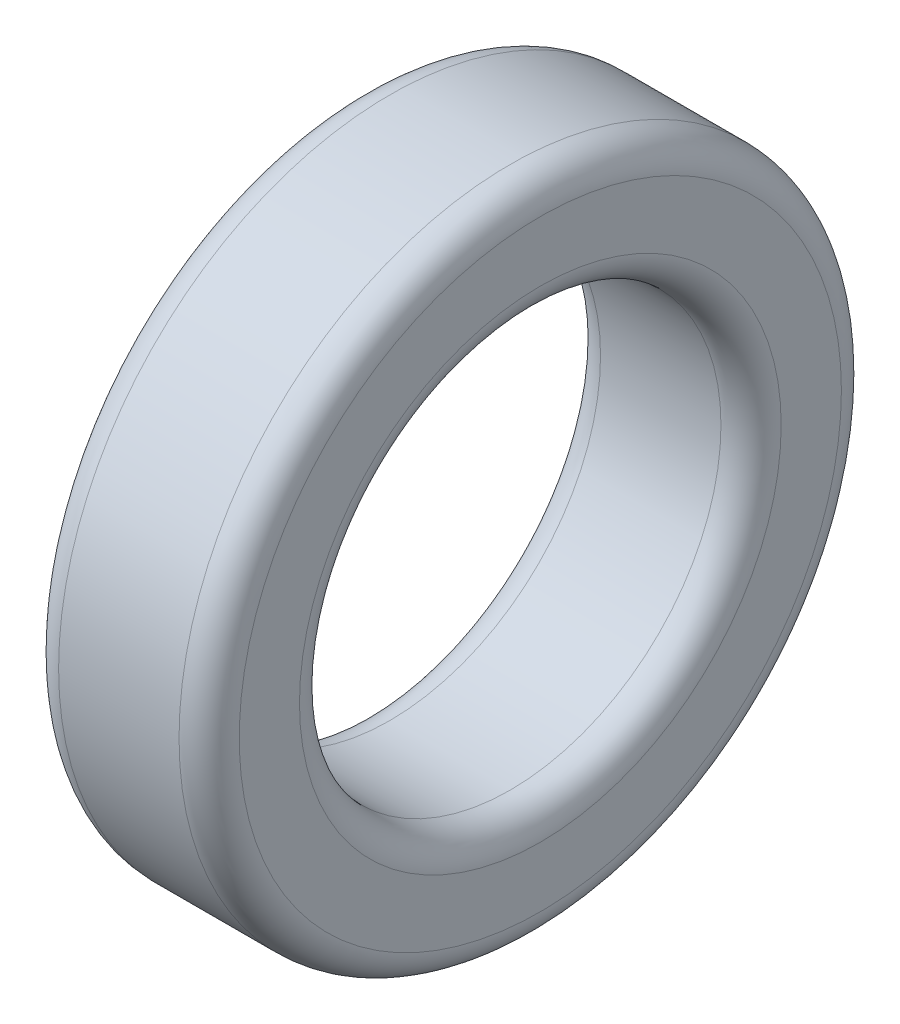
ISO-10303-21;
HEADER;
FILE_DESCRIPTION(('STEP AP214'),'2;1');
FILE_NAME('part.step','',(''),(''),'','','');
FILE_SCHEMA(('AUTOMOTIVE_DESIGN { 1 0 10303 214 1 1 1 1 }'));
ENDSEC;
DATA;
#1=APPLICATION_CONTEXT('core data for automotive mechanical design processes');
#2=APPLICATION_PROTOCOL_DEFINITION('international standard','automotive_design',2000,#1);
#3=PRODUCT_CONTEXT('',#1,'mechanical');
#4=PRODUCT('Part','Part','',(#3));
#5=PRODUCT_RELATED_PRODUCT_CATEGORY('part','',(#4));
#6=PRODUCT_DEFINITION_FORMATION('','',#4);
#7=PRODUCT_DEFINITION_CONTEXT('part definition',#1,'design');
#8=PRODUCT_DEFINITION('design','',#6,#7);
#9=PRODUCT_DEFINITION_SHAPE('','',#8);
#10=(LENGTH_UNIT() NAMED_UNIT(*) SI_UNIT(.MILLI.,.METRE.));
#11=(NAMED_UNIT(*) PLANE_ANGLE_UNIT() SI_UNIT($,.RADIAN.));
#12=(NAMED_UNIT(*) SI_UNIT($,.STERADIAN.) SOLID_ANGLE_UNIT());
#13=UNCERTAINTY_MEASURE_WITH_UNIT(LENGTH_MEASURE(1.E-05),#10,'distance_accuracy_value','');
#14=(GEOMETRIC_REPRESENTATION_CONTEXT(3) GLOBAL_UNCERTAINTY_ASSIGNED_CONTEXT((#13)) GLOBAL_UNIT_ASSIGNED_CONTEXT((#10,
#11,#12)) REPRESENTATION_CONTEXT('',''));
#15=CARTESIAN_POINT('',(0.,0.,0.));
#16=DIRECTION('',(0.,0.,1.));
#17=DIRECTION('',(1.,0.,0.));
#18=AXIS2_PLACEMENT_3D('',#15,#16,#17);
#19=CARTESIAN_POINT('',(11.9999999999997,-40.3284905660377,-94.5071698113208));
#20=DIRECTION('',(1.,0.,0.));
#21=DIRECTION('',(0.,0.,-1.));
#22=AXIS2_PLACEMENT_3D('',#19,#20,#21);
#23=TOROIDAL_SURFACE('',#22,4.99999999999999,0.500000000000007);
#24=CARTESIAN_POINT('',(11.9999999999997,-40.3284905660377,-94.5071698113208));
#25=DIRECTION('',(1.,0.,0.));
#26=DIRECTION('',(0.,0.,-1.));
#27=AXIS2_PLACEMENT_3D('',#24,#25,#26);
#28=CIRCLE('',#27,5.5);
#29=CARTESIAN_POINT('',(11.9999999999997,-40.3284905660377,-100.007169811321));
#30=VERTEX_POINT('',#29);
#31=EDGE_CURVE('E10',#30,#30,#28,.T.);
#32=ORIENTED_EDGE('',*,*,#31,.T.);
#33=EDGE_LOOP('',(#32));
#34=FACE_BOUND('',#33,.T.);
#35=CARTESIAN_POINT('',(12.4999999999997,-40.3284905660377,-94.5071698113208));
#36=DIRECTION('',(1.,0.,0.));
#37=DIRECTION('',(0.,0.,-1.));
#38=AXIS2_PLACEMENT_3D('',#35,#36,#37);
#39=CIRCLE('',#38,4.99999999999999);
#40=CARTESIAN_POINT('',(12.4999999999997,-40.3284905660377,-99.5071698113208));
#41=VERTEX_POINT('',#40);
#42=EDGE_CURVE('E48',#41,#41,#39,.T.);
#43=ORIENTED_EDGE('',*,*,#42,.F.);
#44=EDGE_LOOP('',(#43));
#45=FACE_BOUND('',#44,.T.);
#46=ADVANCED_FACE('F20',(#34,#45),#23,.T.);
#47=CARTESIAN_POINT('',(18.9999999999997,-40.3284905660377,-94.5071698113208));
#48=DIRECTION('',(1.,0.,0.));
#49=DIRECTION('',(0.,0.,-1.));
#50=AXIS2_PLACEMENT_3D('',#47,#48,#49);
#51=CYLINDRICAL_SURFACE('',#50,5.5);
#52=CARTESIAN_POINT('',(9.99999999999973,-40.3284905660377,-94.5071698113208));
#53=DIRECTION('',(1.,0.,0.));
#54=DIRECTION('',(0.,0.,-1.));
#55=AXIS2_PLACEMENT_3D('',#52,#53,#54);
#56=CIRCLE('',#55,5.5);
#57=CARTESIAN_POINT('',(9.99999999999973,-40.3284905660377,-100.007169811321));
#58=VERTEX_POINT('',#57);
#59=EDGE_CURVE('E26',#58,#58,#56,.T.);
#60=ORIENTED_EDGE('',*,*,#59,.T.);
#61=EDGE_LOOP('',(#60));
#62=FACE_BOUND('',#61,.T.);
#63=ORIENTED_EDGE('',*,*,#31,.F.);
#64=EDGE_LOOP('',(#63));
#65=FACE_BOUND('',#64,.T.);
#66=ADVANCED_FACE('F56',(#62,#65),#51,.T.);
#67=CARTESIAN_POINT('',(9.99999999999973,-40.3284905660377,-94.5071698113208));
#68=DIRECTION('',(1.,0.,0.));
#69=DIRECTION('',(0.,0.,-1.));
#70=AXIS2_PLACEMENT_3D('',#67,#68,#69);
#71=TOROIDAL_SURFACE('',#70,4.99999999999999,0.500000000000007);
#72=CARTESIAN_POINT('',(9.49999999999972,-40.3284905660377,-94.5071698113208));
#73=DIRECTION('',(1.,0.,0.));
#74=DIRECTION('',(0.,0.,-1.));
#75=AXIS2_PLACEMENT_3D('',#72,#73,#74);
#76=CIRCLE('',#75,4.99999999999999);
#77=CARTESIAN_POINT('',(9.49999999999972,-40.3284905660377,-99.5071698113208));
#78=VERTEX_POINT('',#77);
#79=EDGE_CURVE('E30',#78,#78,#76,.T.);
#80=ORIENTED_EDGE('',*,*,#79,.T.);
#81=EDGE_LOOP('',(#80));
#82=FACE_BOUND('',#81,.T.);
#83=ORIENTED_EDGE('',*,*,#59,.F.);
#84=EDGE_LOOP('',(#83));
#85=FACE_BOUND('',#84,.T.);
#86=ADVANCED_FACE('F60',(#82,#85),#71,.T.);
#87=CARTESIAN_POINT('',(9.49999999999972,-36.3284905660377,-94.5071698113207));
#88=DIRECTION('',(-1.,0.,0.));
#89=DIRECTION('',(0.,0.,1.));
#90=AXIS2_PLACEMENT_3D('',#87,#88,#89);
#91=PLANE('',#90);
#92=CARTESIAN_POINT('',(9.49999999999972,-40.3284905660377,-94.5071698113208));
#93=DIRECTION('',(1.,0.,0.));
#94=DIRECTION('',(0.,0.,-1.));
#95=AXIS2_PLACEMENT_3D('',#92,#93,#94);
#96=CIRCLE('',#95,4.);
#97=CARTESIAN_POINT('',(9.49999999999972,-40.3284905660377,-98.5071698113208));
#98=VERTEX_POINT('',#97);
#99=EDGE_CURVE('E34',#98,#98,#96,.T.);
#100=ORIENTED_EDGE('',*,*,#99,.T.);
#101=EDGE_LOOP('',(#100));
#102=FACE_BOUND('',#101,.T.);
#103=ORIENTED_EDGE('',*,*,#79,.F.);
#104=EDGE_LOOP('',(#103));
#105=FACE_BOUND('',#104,.T.);
#106=ADVANCED_FACE('F64',(#102,#105),#91,.T.);
#107=CARTESIAN_POINT('',(9.99999999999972,-40.3284905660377,-94.5071698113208));
#108=DIRECTION('',(1.,0.,0.));
#109=DIRECTION('',(0.,0.,-1.));
#110=AXIS2_PLACEMENT_3D('',#107,#108,#109);
#111=TOROIDAL_SURFACE('',#110,4.,0.5);
#112=CARTESIAN_POINT('',(9.99999999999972,-40.3284905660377,-94.5071698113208));
#113=DIRECTION('',(1.,0.,0.));
#114=DIRECTION('',(0.,0.,-1.));
#115=AXIS2_PLACEMENT_3D('',#112,#113,#114);
#116=CIRCLE('',#115,3.5);
#117=CARTESIAN_POINT('',(9.99999999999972,-40.3284905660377,-98.0071698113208));
#118=VERTEX_POINT('',#117);
#119=EDGE_CURVE('E39',#118,#118,#116,.T.);
#120=ORIENTED_EDGE('',*,*,#119,.T.);
#121=EDGE_LOOP('',(#120));
#122=FACE_BOUND('',#121,.T.);
#123=ORIENTED_EDGE('',*,*,#99,.F.);
#124=EDGE_LOOP('',(#123));
#125=FACE_BOUND('',#124,.T.);
#126=ADVANCED_FACE('F71',(#122,#125),#111,.T.);
#127=CARTESIAN_POINT('',(18.9999999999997,-40.3284905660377,-94.5071698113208));
#128=DIRECTION('',(1.,0.,0.));
#129=DIRECTION('',(0.,0.,-1.));
#130=AXIS2_PLACEMENT_3D('',#127,#128,#129);
#131=CYLINDRICAL_SURFACE('',#130,3.5);
#132=CARTESIAN_POINT('',(11.9999999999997,-40.3284905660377,-94.5071698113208));
#133=DIRECTION('',(1.,0.,0.));
#134=DIRECTION('',(0.,0.,-1.));
#135=AXIS2_PLACEMENT_3D('',#132,#133,#134);
#136=CIRCLE('',#135,3.5);
#137=CARTESIAN_POINT('',(11.9999999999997,-40.3284905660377,-98.0071698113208));
#138=VERTEX_POINT('',#137);
#139=EDGE_CURVE('E42',#138,#138,#136,.T.);
#140=ORIENTED_EDGE('',*,*,#139,.T.);
#141=EDGE_LOOP('',(#140));
#142=FACE_BOUND('',#141,.T.);
#143=ORIENTED_EDGE('',*,*,#119,.F.);
#144=EDGE_LOOP('',(#143));
#145=FACE_BOUND('',#144,.T.);
#146=ADVANCED_FACE('F75',(#142,#145),#131,.F.);
#147=CARTESIAN_POINT('',(11.9999999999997,-40.3284905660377,-94.5071698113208));
#148=DIRECTION('',(1.,0.,0.));
#149=DIRECTION('',(0.,0.,-1.));
#150=AXIS2_PLACEMENT_3D('',#147,#148,#149);
#151=TOROIDAL_SURFACE('',#150,4.,0.5);
#152=CARTESIAN_POINT('',(12.4999999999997,-40.3284905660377,-94.5071698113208));
#153=DIRECTION('',(1.,0.,0.));
#154=DIRECTION('',(0.,0.,-1.));
#155=AXIS2_PLACEMENT_3D('',#152,#153,#154);
#156=CIRCLE('',#155,4.);
#157=CARTESIAN_POINT('',(12.4999999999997,-40.3284905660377,-98.5071698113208));
#158=VERTEX_POINT('',#157);
#159=EDGE_CURVE('E45',#158,#158,#156,.T.);
#160=ORIENTED_EDGE('',*,*,#159,.T.);
#161=EDGE_LOOP('',(#160));
#162=FACE_BOUND('',#161,.T.);
#163=ORIENTED_EDGE('',*,*,#139,.F.);
#164=EDGE_LOOP('',(#163));
#165=FACE_BOUND('',#164,.T.);
#166=ADVANCED_FACE('F79',(#162,#165),#151,.T.);
#167=CARTESIAN_POINT('',(12.4999999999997,-35.3284905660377,-94.5071698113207));
#168=DIRECTION('',(1.,0.,0.));
#169=DIRECTION('',(0.,0.,-1.));
#170=AXIS2_PLACEMENT_3D('',#167,#168,#169);
#171=PLANE('',#170);
#172=ORIENTED_EDGE('',*,*,#42,.T.);
#173=EDGE_LOOP('',(#172));
#174=FACE_BOUND('',#173,.T.);
#175=ORIENTED_EDGE('',*,*,#159,.F.);
#176=EDGE_LOOP('',(#175));
#177=FACE_BOUND('',#176,.T.);
#178=ADVANCED_FACE('F52',(#174,#177),#171,.T.);
#179=CLOSED_SHELL('',(#46,#66,#86,#106,#126,#146,#166,#178));
#180=MANIFOLD_SOLID_BREP('B2',#179);
#181=ADVANCED_BREP_SHAPE_REPRESENTATION('',(#18,#180),#14);
#182=SHAPE_DEFINITION_REPRESENTATION(#9,#181);
ENDSEC;
END-ISO-10303-21;
